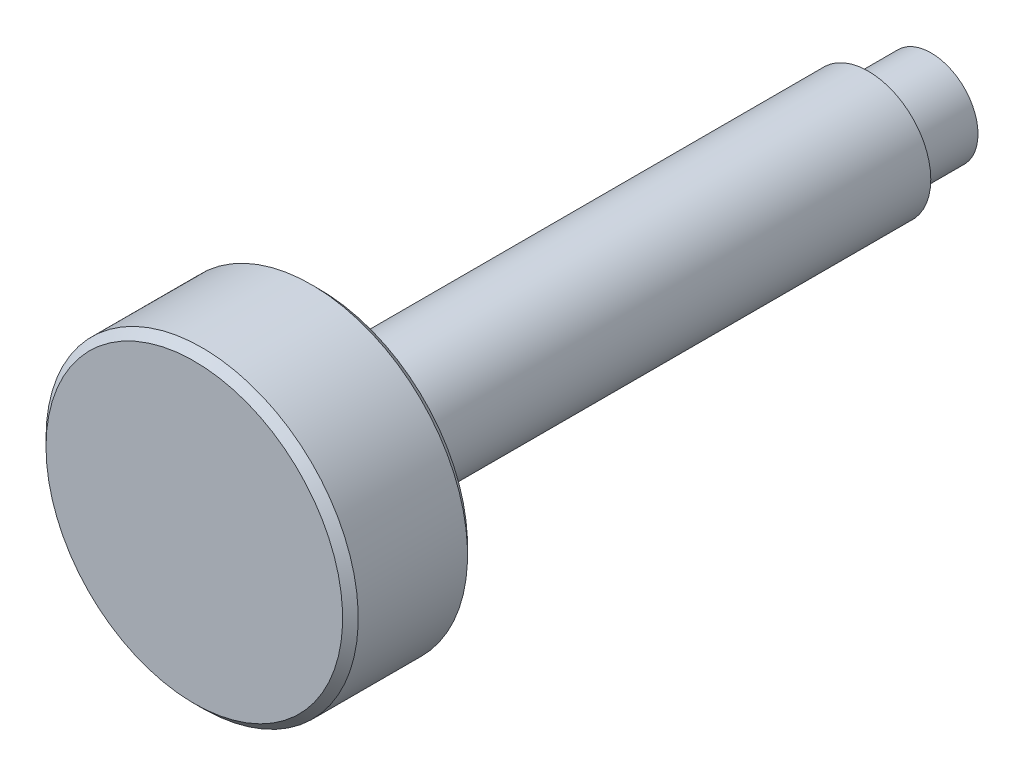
ISO-10303-21;
HEADER;
FILE_DESCRIPTION(('STEP AP214'),'2;1');
FILE_NAME('part.step','',(''),(''),'','','');
FILE_SCHEMA(('AUTOMOTIVE_DESIGN { 1 0 10303 214 1 1 1 1 }'));
ENDSEC;
DATA;
#1=APPLICATION_CONTEXT('core data for automotive mechanical design processes');
#2=APPLICATION_PROTOCOL_DEFINITION('international standard','automotive_design',2000,#1);
#3=PRODUCT_CONTEXT('',#1,'mechanical');
#4=PRODUCT('Part','Part','',(#3));
#5=PRODUCT_RELATED_PRODUCT_CATEGORY('part','',(#4));
#6=PRODUCT_DEFINITION_FORMATION('','',#4);
#7=PRODUCT_DEFINITION_CONTEXT('part definition',#1,'design');
#8=PRODUCT_DEFINITION('design','',#6,#7);
#9=PRODUCT_DEFINITION_SHAPE('','',#8);
#10=(LENGTH_UNIT() NAMED_UNIT(*) SI_UNIT(.MILLI.,.METRE.));
#11=(NAMED_UNIT(*) PLANE_ANGLE_UNIT() SI_UNIT($,.RADIAN.));
#12=(NAMED_UNIT(*) SI_UNIT($,.STERADIAN.) SOLID_ANGLE_UNIT());
#13=UNCERTAINTY_MEASURE_WITH_UNIT(LENGTH_MEASURE(1.E-05),#10,'distance_accuracy_value','');
#14=(GEOMETRIC_REPRESENTATION_CONTEXT(3) GLOBAL_UNCERTAINTY_ASSIGNED_CONTEXT((#13)) GLOBAL_UNIT_ASSIGNED_CONTEXT((#10,
#11,#12)) REPRESENTATION_CONTEXT('',''));
#15=CARTESIAN_POINT('',(0.,0.,0.));
#16=DIRECTION('',(0.,0.,1.));
#17=DIRECTION('',(1.,0.,0.));
#18=AXIS2_PLACEMENT_3D('',#15,#16,#17);
#19=CARTESIAN_POINT('',(0.,0.,80.));
#20=DIRECTION('',(0.,0.,1.));
#21=DIRECTION('',(1.,0.,0.));
#22=AXIS2_PLACEMENT_3D('',#19,#20,#21);
#23=CYLINDRICAL_SURFACE('',#22,20.);
#24=CARTESIAN_POINT('',(0.,0.,95.));
#25=DIRECTION('',(0.,0.,-1.));
#26=DIRECTION('',(-1.,0.,0.));
#27=AXIS2_PLACEMENT_3D('',#24,#25,#26);
#28=CIRCLE('',#27,20.);
#29=CARTESIAN_POINT('',(-20.,0.,95.));
#30=VERTEX_POINT('',#29);
#31=EDGE_CURVE('E23',#30,#30,#28,.T.);
#32=ORIENTED_EDGE('',*,*,#31,.T.);
#33=EDGE_LOOP('',(#32));
#34=FACE_BOUND('',#33,.T.);
#35=CARTESIAN_POINT('',(0.,0.,81.));
#36=DIRECTION('',(0.,0.,-1.));
#37=DIRECTION('',(-1.,0.,0.));
#38=AXIS2_PLACEMENT_3D('',#35,#36,#37);
#39=CIRCLE('',#38,20.);
#40=CARTESIAN_POINT('',(-20.,0.,81.));
#41=VERTEX_POINT('',#40);
#42=EDGE_CURVE('E27',#41,#41,#39,.F.);
#43=ORIENTED_EDGE('',*,*,#42,.T.);
#44=EDGE_LOOP('',(#43));
#45=FACE_BOUND('',#44,.T.);
#46=ADVANCED_FACE('F12',(#34,#45),#23,.T.);
#47=CARTESIAN_POINT('',(0.,0.,80.));
#48=DIRECTION('',(0.,0.,-1.));
#49=DIRECTION('',(-1.,0.,0.));
#50=AXIS2_PLACEMENT_3D('',#47,#48,#49);
#51=PLANE('',#50);
#52=CARTESIAN_POINT('',(0.,0.,80.));
#53=DIRECTION('',(0.,0.,-1.));
#54=DIRECTION('',(-1.,0.,0.));
#55=AXIS2_PLACEMENT_3D('',#52,#53,#54);
#56=CIRCLE('',#55,19.);
#57=CARTESIAN_POINT('',(-19.,0.,80.));
#58=VERTEX_POINT('',#57);
#59=EDGE_CURVE('E8',#58,#58,#56,.T.);
#60=ORIENTED_EDGE('',*,*,#59,.T.);
#61=EDGE_LOOP('',(#60));
#62=FACE_BOUND('',#61,.T.);
#63=CARTESIAN_POINT('',(0.,0.,80.));
#64=DIRECTION('',(0.,0.,-1.));
#65=DIRECTION('',(-1.,0.,0.));
#66=AXIS2_PLACEMENT_3D('',#63,#64,#65);
#67=CIRCLE('',#66,8.6);
#68=CARTESIAN_POINT('',(-8.6,0.,80.));
#69=VERTEX_POINT('',#68);
#70=EDGE_CURVE('E32',#69,#69,#67,.F.);
#71=ORIENTED_EDGE('',*,*,#70,.T.);
#72=EDGE_LOOP('',(#71));
#73=FACE_BOUND('',#72,.T.);
#74=ADVANCED_FACE('F66',(#62,#73),#51,.T.);
#75=CARTESIAN_POINT('',(0.,0.,96.));
#76=DIRECTION('',(0.,0.,-1.));
#77=DIRECTION('',(-1.,0.,0.));
#78=AXIS2_PLACEMENT_3D('',#75,#76,#77);
#79=PLANE('',#78);
#80=CARTESIAN_POINT('',(0.,0.,96.));
#81=DIRECTION('',(0.,0.,-1.));
#82=DIRECTION('',(-1.,0.,0.));
#83=AXIS2_PLACEMENT_3D('',#80,#81,#82);
#84=CIRCLE('',#83,19.);
#85=CARTESIAN_POINT('',(-19.,0.,96.));
#86=VERTEX_POINT('',#85);
#87=EDGE_CURVE('E19',#86,#86,#84,.F.);
#88=ORIENTED_EDGE('',*,*,#87,.T.);
#89=EDGE_LOOP('',(#88));
#90=FACE_BOUND('',#89,.T.);
#91=ADVANCED_FACE('F72',(#90),#79,.F.);
#92=CARTESIAN_POINT('',(0.,0.,80.));
#93=DIRECTION('',(0.,0.,1.));
#94=DIRECTION('',(1.,0.,0.));
#95=AXIS2_PLACEMENT_3D('',#92,#93,#94);
#96=CYLINDRICAL_SURFACE('',#95,8.);
#97=CARTESIAN_POINT('',(0.,0.,79.4));
#98=DIRECTION('',(0.,0.,-1.));
#99=DIRECTION('',(-1.,0.,0.));
#100=AXIS2_PLACEMENT_3D('',#97,#98,#99);
#101=CIRCLE('',#100,8.);
#102=CARTESIAN_POINT('',(-8.,0.,79.4));
#103=VERTEX_POINT('',#102);
#104=EDGE_CURVE('E35',#103,#103,#101,.T.);
#105=ORIENTED_EDGE('',*,*,#104,.T.);
#106=EDGE_LOOP('',(#105));
#107=FACE_BOUND('',#106,.T.);
#108=CARTESIAN_POINT('',(0.,0.,9.6547005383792));
#109=DIRECTION('',(0.,0.,1.));
#110=DIRECTION('',(1.,0.,0.));
#111=AXIS2_PLACEMENT_3D('',#108,#109,#110);
#112=CIRCLE('',#111,8.);
#113=CARTESIAN_POINT('',(8.,0.,9.6547005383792));
#114=VERTEX_POINT('',#113);
#115=EDGE_CURVE('E38',#114,#114,#112,.T.);
#116=ORIENTED_EDGE('',*,*,#115,.T.);
#117=EDGE_LOOP('',(#116));
#118=FACE_BOUND('',#117,.T.);
#119=ADVANCED_FACE('F125',(#107,#118),#96,.T.);
#120=CARTESIAN_POINT('',(0.,0.,9.6547005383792));
#121=DIRECTION('',(0.,0.,1.));
#122=DIRECTION('',(1.,0.,0.));
#123=AXIS2_PLACEMENT_3D('',#120,#121,#122);
#124=CONICAL_SURFACE('',#123,8.,1.0471975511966);
#125=CARTESIAN_POINT('',(0.,0.,8.5));
#126=DIRECTION('',(0.,0.,1.));
#127=DIRECTION('',(1.,0.,0.));
#128=AXIS2_PLACEMENT_3D('',#125,#126,#127);
#129=CIRCLE('',#128,6.);
#130=CARTESIAN_POINT('',(6.,0.,8.5));
#131=VERTEX_POINT('',#130);
#132=EDGE_CURVE('E41',#131,#131,#129,.T.);
#133=ORIENTED_EDGE('',*,*,#132,.T.);
#134=EDGE_LOOP('',(#133));
#135=FACE_BOUND('',#134,.T.);
#136=ORIENTED_EDGE('',*,*,#115,.F.);
#137=EDGE_LOOP('',(#136));
#138=FACE_BOUND('',#137,.T.);
#139=ADVANCED_FACE('F63',(#135,#138),#124,.T.);
#140=CARTESIAN_POINT('',(0.,0.,80.));
#141=DIRECTION('',(0.,0.,1.));
#142=DIRECTION('',(1.,0.,0.));
#143=AXIS2_PLACEMENT_3D('',#140,#141,#142);
#144=CYLINDRICAL_SURFACE('',#143,6.);
#145=CARTESIAN_POINT('',(0.,0.,1.60769515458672));
#146=DIRECTION('',(0.,0.,1.));
#147=DIRECTION('',(1.,0.,0.));
#148=AXIS2_PLACEMENT_3D('',#145,#146,#147);
#149=CIRCLE('',#148,6.);
#150=CARTESIAN_POINT('',(6.,0.,1.60769515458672));
#151=VERTEX_POINT('',#150);
#152=EDGE_CURVE('E44',#151,#151,#149,.T.);
#153=ORIENTED_EDGE('',*,*,#152,.T.);
#154=EDGE_LOOP('',(#153));
#155=FACE_BOUND('',#154,.T.);
#156=ORIENTED_EDGE('',*,*,#132,.F.);
#157=EDGE_LOOP('',(#156));
#158=FACE_BOUND('',#157,.T.);
#159=ADVANCED_FACE('F48',(#155,#158),#144,.T.);
#160=CARTESIAN_POINT('',(0.,0.,12.));
#161=DIRECTION('',(0.,0.,1.));
#162=DIRECTION('',(1.,0.,0.));
#163=AXIS2_PLACEMENT_3D('',#160,#161,#162);
#164=SPHERICAL_SURFACE('',#163,12.);
#165=ORIENTED_EDGE('',*,*,#152,.F.);
#166=EDGE_LOOP('',(#165));
#167=FACE_BOUND('',#166,.T.);
#168=ADVANCED_FACE('F51',(#167),#164,.T.);
#169=CARTESIAN_POINT('',(0.,0.,79.4));
#170=DIRECTION('',(0.,0.,-1.));
#171=DIRECTION('',(-1.,0.,0.));
#172=AXIS2_PLACEMENT_3D('',#169,#170,#171);
#173=TOROIDAL_SURFACE('',#172,8.6,0.6);
#174=ORIENTED_EDGE('',*,*,#70,.F.);
#175=EDGE_LOOP('',(#174));
#176=FACE_BOUND('',#175,.T.);
#177=ORIENTED_EDGE('',*,*,#104,.F.);
#178=EDGE_LOOP('',(#177));
#179=FACE_BOUND('',#178,.T.);
#180=ADVANCED_FACE('F53',(#176,#179),#173,.F.);
#181=CARTESIAN_POINT('',(0.,0.,95.));
#182=DIRECTION('',(0.,0.,-1.));
#183=DIRECTION('',(-1.,0.,0.));
#184=AXIS2_PLACEMENT_3D('',#181,#182,#183);
#185=CONICAL_SURFACE('',#184,20.,0.785398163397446);
#186=ORIENTED_EDGE('',*,*,#87,.F.);
#187=EDGE_LOOP('',(#186));
#188=FACE_BOUND('',#187,.T.);
#189=ORIENTED_EDGE('',*,*,#31,.F.);
#190=EDGE_LOOP('',(#189));
#191=FACE_BOUND('',#190,.T.);
#192=ADVANCED_FACE('F60',(#188,#191),#185,.T.);
#193=CARTESIAN_POINT('',(0.,0.,80.));
#194=DIRECTION('',(0.,0.,1.));
#195=DIRECTION('',(1.,0.,0.));
#196=AXIS2_PLACEMENT_3D('',#193,#194,#195);
#197=CONICAL_SURFACE('',#196,19.,0.785398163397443);
#198=ORIENTED_EDGE('',*,*,#42,.F.);
#199=EDGE_LOOP('',(#198));
#200=FACE_BOUND('',#199,.T.);
#201=ORIENTED_EDGE('',*,*,#59,.F.);
#202=EDGE_LOOP('',(#201));
#203=FACE_BOUND('',#202,.T.);
#204=ADVANCED_FACE('F14',(#200,#203),#197,.T.);
#205=CLOSED_SHELL('',(#46,#74,#91,#119,#139,#159,#168,#180,#192,#204));
#206=MANIFOLD_SOLID_BREP('B1',#205);
#207=ADVANCED_BREP_SHAPE_REPRESENTATION('',(#18,#206),#14);
#208=SHAPE_DEFINITION_REPRESENTATION(#9,#207);
ENDSEC;
END-ISO-10303-21;
